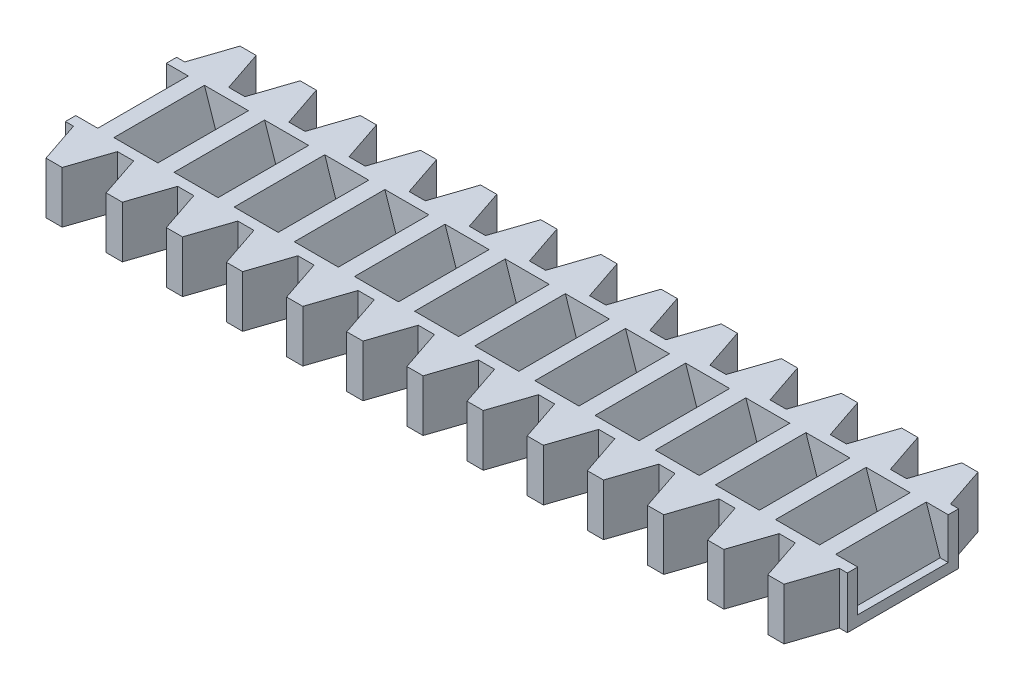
from build123d import *

# Parameters (mm, degrees)
SKETCH_1_W                     = 4.65
SKETCH_1_H                     = 8.6
EXTRUDE_1_DEPTH                = 4
EXTRUDE_2_DEPTH                = 4
CUT_EXTRUDE_1_DEPTH            = 3.5
PATTERN_LINEAR_4_COUNT         = 13
PATTERN_LINEAR_4_PITCH         = 4.65
PATTERN_LINEAR_4_COPY_1_DEPTH  = 4
PATTERN_LINEAR_4_COPY_2_DEPTH  = 4
PATTERN_LINEAR_4_COPY_3_DEPTH  = 4
PATTERN_LINEAR_4_COPY_4_DEPTH  = 4
PATTERN_LINEAR_4_COPY_5_DEPTH  = 4
PATTERN_LINEAR_4_COPY_6_DEPTH  = 4
PATTERN_LINEAR_4_COPY_7_DEPTH  = 4
PATTERN_LINEAR_4_COPY_8_DEPTH  = 4
PATTERN_LINEAR_4_COPY_9_DEPTH  = 4
PATTERN_LINEAR_4_COPY_10_DEPTH = 4
PATTERN_LINEAR_4_COPY_11_DEPTH = 4
PATTERN_LINEAR_4_COPY_12_DEPTH = 4
EXTRUDE_START                  = 1
EXTRUDE_4_DEPTH                = 53.8
FILLET_1_R                     = 0.1


with BuildPart() as part:
    # Sketch 1 → Extrude 1 (new body)
    with BuildSketch(Plane(origin=(0, 0, 0), x_dir=(1, 0, 0), z_dir=(0, 1, 0))):
        Rectangle(SKETCH_1_W, SKETCH_1_H)
    extrude_1 = extrude(amount=EXTRUDE_1_DEPTH)

    # Sketch 3 → Extrude 2 (add)
    with BuildSketch(Plane(origin=(0, 0, 0), x_dir=(1, 0, 0), z_dir=(0, 1, 0))):
        Polygon((0.625, 7.5), (-0.625, 7.5), (-1.7, 4.3), (1.7, 4.3), align=None)
    extrude_2 = extrude(amount=EXTRUDE_2_DEPTH)

    # Mirror 1: Extrude 2 across plane
    add(extrude_2.mirror(Plane.XY))

    # Sketch 4 → Cut-Extrude 1 (cut, symmetric)
    with BuildSketch(Plane.XY):
        Polygon((-0.625, 4), (-2.325, 4), (-2.325, 0.8), (-1.7, 0.8), align=None)
        Polygon((1.7, 0.8), (2.325, 0.8), (2.325, 4), (0.625, 4), align=None)
    cut_extrude_1 = extrude(amount=CUT_EXTRUDE_1_DEPTH, both=True, mode=Mode.SUBTRACT)

    # Pattern Linear 4: Extrude 1, Extrude 2, Cut-Extrude 1 ×13
    with Locations(*[(i * PATTERN_LINEAR_4_PITCH, 0, 0) for i in range(1, PATTERN_LINEAR_4_COUNT)]):
        add(extrude_1)
        add(extrude_2)
        add(cut_extrude_1, mode=Mode.SUBTRACT)

    # Pattern Linear 4 copy 1 sketch → Pattern Linear 4 copy 1 (add)
    with BuildSketch(Plane(origin=(4.65, 0, 0), x_dir=(1, 0, 0), z_dir=(0, 1, 0))):
        Polygon((0.625, -7.5), (-0.625, -7.5), (-1.7, -4.3), (1.7, -4.3), align=None)
    extrude(amount=PATTERN_LINEAR_4_COPY_1_DEPTH)

    # Pattern Linear 4 copy 2 sketch → Pattern Linear 4 copy 2 (add)
    with BuildSketch(Plane(origin=(9.3, 0, 0), x_dir=(1, 0, 0), z_dir=(0, 1, 0))):
        Polygon((0.625, -7.5), (-0.625, -7.5), (-1.7, -4.3), (1.7, -4.3), align=None)
    extrude(amount=PATTERN_LINEAR_4_COPY_2_DEPTH)

    # Pattern Linear 4 copy 3 sketch → Pattern Linear 4 copy 3 (add)
    with BuildSketch(Plane(origin=(13.95, 0, 0), x_dir=(1, 0, 0), z_dir=(0, 1, 0))):
        Polygon((0.625, -7.5), (-0.625, -7.5), (-1.7, -4.3), (1.7, -4.3), align=None)
    extrude(amount=PATTERN_LINEAR_4_COPY_3_DEPTH)

    # Pattern Linear 4 copy 4 sketch → Pattern Linear 4 copy 4 (add)
    with BuildSketch(Plane(origin=(18.6, 0, 0), x_dir=(1, 0, 0), z_dir=(0, 1, 0))):
        Polygon((0.625, -7.5), (-0.625, -7.5), (-1.7, -4.3), (1.7, -4.3), align=None)
    extrude(amount=PATTERN_LINEAR_4_COPY_4_DEPTH)

    # Pattern Linear 4 copy 5 sketch → Pattern Linear 4 copy 5 (add)
    with BuildSketch(Plane(origin=(23.25, 0, 0), x_dir=(1, 0, 0), z_dir=(0, 1, 0))):
        Polygon((0.625, -7.5), (-0.625, -7.5), (-1.7, -4.3), (1.7, -4.3), align=None)
    extrude(amount=PATTERN_LINEAR_4_COPY_5_DEPTH)

    # Pattern Linear 4 copy 6 sketch → Pattern Linear 4 copy 6 (add)
    with BuildSketch(Plane(origin=(27.9, 0, 0), x_dir=(1, 0, 0), z_dir=(0, 1, 0))):
        Polygon((0.625, -7.5), (-0.625, -7.5), (-1.7, -4.3), (1.7, -4.3), align=None)
    extrude(amount=PATTERN_LINEAR_4_COPY_6_DEPTH)

    # Pattern Linear 4 copy 7 sketch → Pattern Linear 4 copy 7 (add)
    with BuildSketch(Plane(origin=(32.55, 0, 0), x_dir=(1, 0, 0), z_dir=(0, 1, 0))):
        Polygon((0.625, -7.5), (-0.625, -7.5), (-1.7, -4.3), (1.7, -4.3), align=None)
    extrude(amount=PATTERN_LINEAR_4_COPY_7_DEPTH)

    # Pattern Linear 4 copy 8 sketch → Pattern Linear 4 copy 8 (add)
    with BuildSketch(Plane(origin=(37.2, 0, 0), x_dir=(1, 0, 0), z_dir=(0, 1, 0))):
        Polygon((0.625, -7.5), (-0.625, -7.5), (-1.7, -4.3), (1.7, -4.3), align=None)
    extrude(amount=PATTERN_LINEAR_4_COPY_8_DEPTH)

    # Pattern Linear 4 copy 9 sketch → Pattern Linear 4 copy 9 (add)
    with BuildSketch(Plane(origin=(41.85, 0, 0), x_dir=(1, 0, 0), z_dir=(0, 1, 0))):
        Polygon((0.625, -7.5), (-0.625, -7.5), (-1.7, -4.3), (1.7, -4.3), align=None)
    extrude(amount=PATTERN_LINEAR_4_COPY_9_DEPTH)

    # Pattern Linear 4 copy 10 sketch → Pattern Linear 4 copy 10 (add)
    with BuildSketch(Plane(origin=(46.5, 0, 0), x_dir=(1, 0, 0), z_dir=(0, 1, 0))):
        Polygon((0.625, -7.5), (-0.625, -7.5), (-1.7, -4.3), (1.7, -4.3), align=None)
    extrude(amount=PATTERN_LINEAR_4_COPY_10_DEPTH)

    # Pattern Linear 4 copy 11 sketch → Pattern Linear 4 copy 11 (add)
    with BuildSketch(Plane(origin=(51.15, 0, 0), x_dir=(1, 0, 0), z_dir=(0, 1, 0))):
        Polygon((0.625, -7.5), (-0.625, -7.5), (-1.7, -4.3), (1.7, -4.3), align=None)
    extrude(amount=PATTERN_LINEAR_4_COPY_11_DEPTH)

    # Pattern Linear 4 copy 12 sketch → Pattern Linear 4 copy 12 (add)
    with BuildSketch(Plane(origin=(55.8, 0, 0), x_dir=(1, 0, 0), z_dir=(0, 1, 0))):
        Polygon((0.625, -7.5), (-0.625, -7.5), (-1.7, -4.3), (1.7, -4.3), align=None)
    extrude(amount=PATTERN_LINEAR_4_COPY_12_DEPTH)

    # Sketch 6 → Extrude 4 (add)
    with BuildSketch(Plane(origin=(0, 0, 0), x_dir=(0, 0, -1), z_dir=(1, 0, 0)).offset(EXTRUDE_START)):
        with BuildLine():
            Line((1.5, 0), (0.5, 0))
            Line((0.5, 0), (0.5, -1.07225346))
            Line((0.5, -1.07225346), (1.165769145, -2.5))
            Line((1.165769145, -2.5), (1.95, -2.5))
            Line((1.95, -2.5), (1.95, -1.555590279))
            ThreePointArc((1.95, -1.555590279), (1.780042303, -1.088161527), (1.5, -0.677124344))
            Line((1.5, -0.677124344), (1.5, 0))
        make_face()
        with BuildLine():
            Line((-0.5, -1.07225346), (-1.165769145, -2.5))
            Line((-1.165769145, -2.5), (-1.95, -2.5))
            Line((-1.95, -2.5), (-1.95, -1.555590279))
            ThreePointArc((-1.95, -1.555590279), (-1.780042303, -1.088161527), (-1.5, -0.677124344))
            Line((-1.5, -0.677124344), (-1.5, 0))
            Line((-1.5, 0), (-0.5, 0))
            Line((-0.5, 0), (-0.5, -1.07225346))
        make_face()
    extrude(amount=EXTRUDE_4_DEPTH)

    # Fillet 1
    fillet_1_edges = [part.edges().sort_by_distance(p)[0] for p in [
        (1, -2.5, -1.557884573),
        (27.9, -2.5, -1.165769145),
        (27.9, -2.5, -1.95),
        (54.8, -2.5, -1.557884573),
        (1, -2.5, 1.557884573),
        (27.9, -2.5, 1.95),
        (27.9, -2.5, 1.165769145),
        (54.8, -2.5, 1.557884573),
    ]]
    fillet(fillet_1_edges, radius=FILLET_1_R)


solid = part.part
